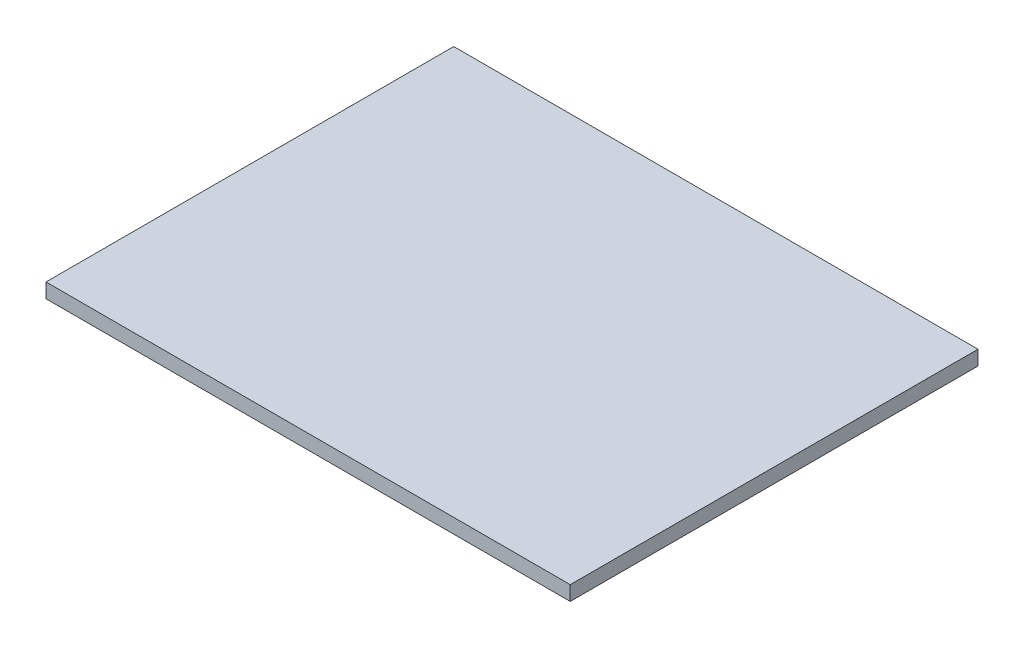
from build123d import *

# Parameters (mm, degrees)
SKETCH1_W           = 108
SKETCH1_H           = 84
BOSS_EXTRUDE1_DEPTH = 3


with BuildPart() as part:
    # Sketch1 → Boss-Extrude1 (new body)
    with BuildSketch(Plane(origin=(0, 0, 0), x_dir=(1, 0, 0), z_dir=(0, 1, 0))):
        with Locations((54, 42)):
            Rectangle(SKETCH1_W, SKETCH1_H)
    extrude(amount=BOSS_EXTRUDE1_DEPTH)


solid = part.part
